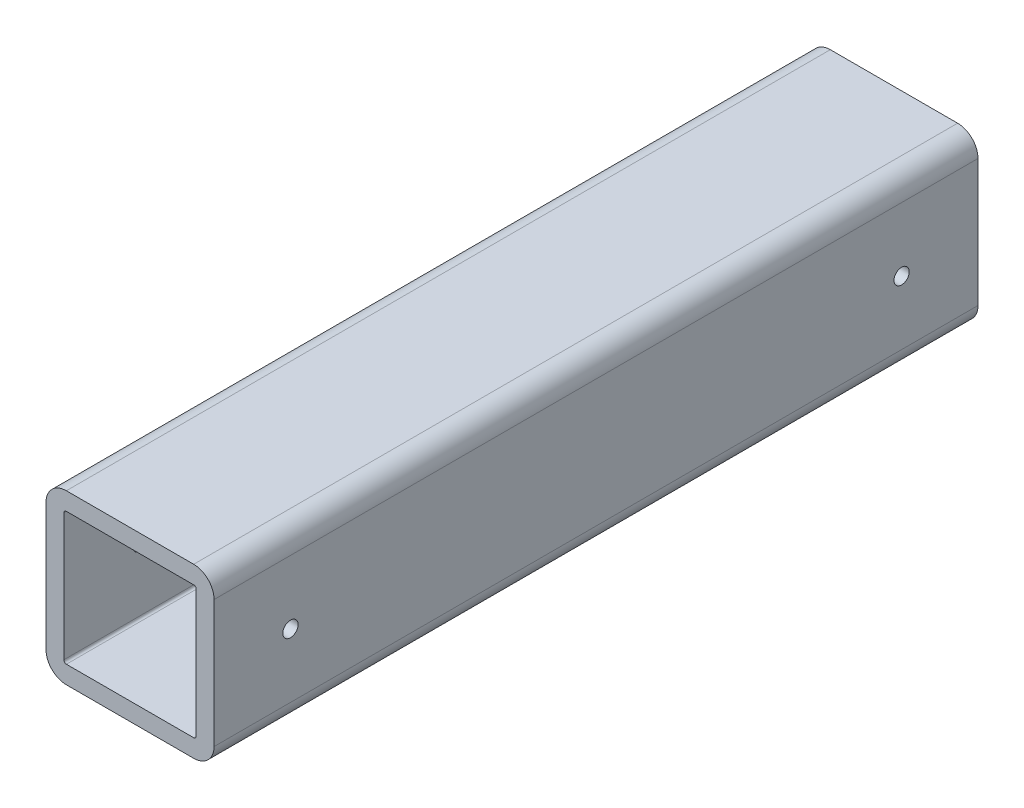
from build123d import *

# Parameters (mm, degrees)
BASE_EXTRUSION_DEPTH    = 300
ESQUISSE3_R             = 3
ENL_V_MAT_EXTRU_1_DEPTH = 315.184659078


with BuildPart() as part:
    # Esquisse2 → Base-Extrusion (new body)
    with BuildSketch(Plane.XY):
        with BuildLine():
            Line((8, 0), (58, 0))
            ThreePointArc((58, 0), (63.656854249, -2.343145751), (66, -8))
            Line((66, -8), (66, -58))
            ThreePointArc((66, -58), (63.656854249, -63.656854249), (58, -66))
            Line((58, -66), (8, -66))
            ThreePointArc((8, -66), (2.343145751, -63.656854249), (0, -58))
            Line((0, -58), (0, -8))
            ThreePointArc((0, -8), (2.343145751, -2.343145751), (8, 0))
        make_face()
        with BuildLine():
            Line((8, -7), (58, -7))
            ThreePointArc((58, -7), (58.707106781, -7.292893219), (59, -8))
            Line((59, -8), (59, -58))
            ThreePointArc((59, -58), (58.707106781, -58.707106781), (58, -59))
            Line((58, -59), (8, -59))
            ThreePointArc((8, -59), (7.292893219, -58.707106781), (7, -58))
            Line((7, -58), (7, -8))
            ThreePointArc((7, -8), (7.292893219, -7.292893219), (8, -7))
        make_face(mode=Mode.SUBTRACT)
    extrude(amount=BASE_EXTRUSION_DEPTH)

    # Esquisse3 → Enl_v. mat.-Extru.1 (cut, through all)
    with BuildSketch(Plane.ZY):
        with Locations(Location((30, -33, 0), (0, 0, 270))):
            Circle(ESQUISSE3_R)
        with Locations(Location((270, -33, 0), (0, 0, 270))):
            Circle(ESQUISSE3_R)
    extrude(amount=-ENL_V_MAT_EXTRU_1_DEPTH, mode=Mode.SUBTRACT)


solid = part.part
